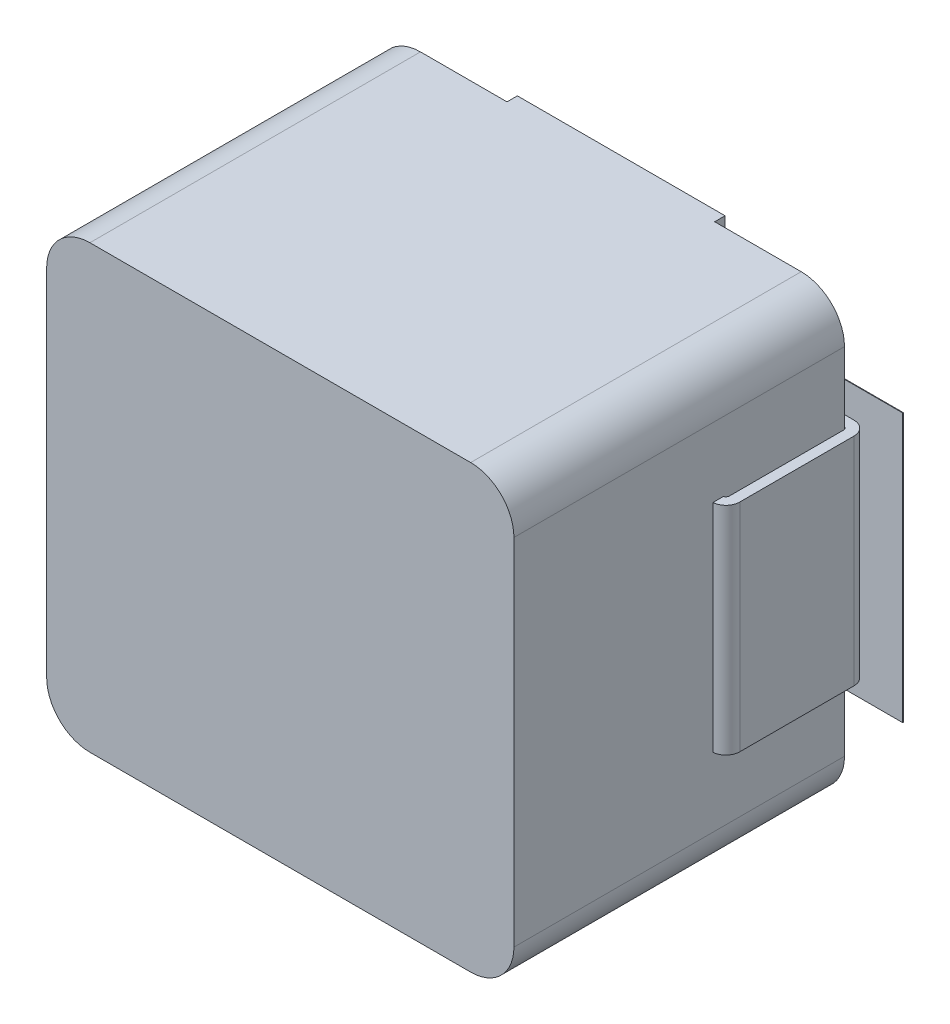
ISO-10303-21;
HEADER;
FILE_DESCRIPTION(('STEP AP214'),'2;1');
FILE_NAME('part.step','',(''),(''),'','','');
FILE_SCHEMA(('AUTOMOTIVE_DESIGN { 1 0 10303 214 1 1 1 1 }'));
ENDSEC;
DATA;
#1=APPLICATION_CONTEXT('core data for automotive mechanical design processes');
#2=APPLICATION_PROTOCOL_DEFINITION('international standard','automotive_design',2000,#1);
#3=PRODUCT_CONTEXT('',#1,'mechanical');
#4=PRODUCT('Part','Part','',(#3));
#5=PRODUCT_RELATED_PRODUCT_CATEGORY('part','',(#4));
#6=PRODUCT_DEFINITION_FORMATION('','',#4);
#7=PRODUCT_DEFINITION_CONTEXT('part definition',#1,'design');
#8=PRODUCT_DEFINITION('design','',#6,#7);
#9=PRODUCT_DEFINITION_SHAPE('','',#8);
#10=(LENGTH_UNIT() NAMED_UNIT(*) SI_UNIT(.MILLI.,.METRE.));
#11=(NAMED_UNIT(*) PLANE_ANGLE_UNIT() SI_UNIT($,.RADIAN.));
#12=(NAMED_UNIT(*) SI_UNIT($,.STERADIAN.) SOLID_ANGLE_UNIT());
#13=UNCERTAINTY_MEASURE_WITH_UNIT(LENGTH_MEASURE(1.E-05),#10,'distance_accuracy_value','');
#14=(GEOMETRIC_REPRESENTATION_CONTEXT(3) GLOBAL_UNCERTAINTY_ASSIGNED_CONTEXT((#13)) GLOBAL_UNIT_ASSIGNED_CONTEXT((#10,
#11,#12)) REPRESENTATION_CONTEXT('',''));
#15=CARTESIAN_POINT('',(0.,0.,0.));
#16=DIRECTION('',(0.,0.,1.));
#17=DIRECTION('',(1.,0.,0.));
#18=AXIS2_PLACEMENT_3D('',#15,#16,#17);
#19=CARTESIAN_POINT('',(3.4163,-1.5875,0.0762));
#20=DIRECTION('',(0.,0.,-1.));
#21=DIRECTION('',(-1.,0.,0.));
#22=AXIS2_PLACEMENT_3D('',#19,#20,#21);
#23=PLANE('',#22);
#24=DIRECTION('',(0.,1.,0.));
#25=VECTOR('',#24,1.);
#26=CARTESIAN_POINT('',(3.4163,-1.5875,0.0761999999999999));
#27=LINE('',#26,#25);
#28=CARTESIAN_POINT('',(3.4163,-1.5875,0.0762));
#29=VERTEX_POINT('',#28);
#30=CARTESIAN_POINT('',(3.4163,1.5875,0.0762));
#31=VERTEX_POINT('',#30);
#32=EDGE_CURVE('P0_E207',#29,#31,#27,.T.);
#33=ORIENTED_EDGE('',*,*,#32,.F.);
#34=DIRECTION('',(-1.,0.,0.));
#35=VECTOR('',#34,1.);
#36=CARTESIAN_POINT('',(3.4163,-1.5875,0.0762));
#37=LINE('',#36,#35);
#38=CARTESIAN_POINT('',(2.0447,-1.5875,0.0762));
#39=VERTEX_POINT('',#38);
#40=EDGE_CURVE('P0_E361',#29,#39,#37,.T.);
#41=ORIENTED_EDGE('',*,*,#40,.T.);
#42=DIRECTION('',(0.,1.,0.));
#43=VECTOR('',#42,1.);
#44=CARTESIAN_POINT('',(2.0447,-1.5875,0.0762));
#45=LINE('',#44,#43);
#46=CARTESIAN_POINT('',(2.0447,1.5875,0.0762));
#47=VERTEX_POINT('',#46);
#48=EDGE_CURVE('P0_E356',#47,#39,#45,.F.);
#49=ORIENTED_EDGE('',*,*,#48,.F.);
#50=DIRECTION('',(-1.,0.,0.));
#51=VECTOR('',#50,1.);
#52=CARTESIAN_POINT('',(3.4163,1.5875,0.0762));
#53=LINE('',#52,#51);
#54=EDGE_CURVE('P0_E380',#47,#31,#53,.F.);
#55=ORIENTED_EDGE('',*,*,#54,.T.);
#56=EDGE_LOOP('',(#33,#41,#49,#55));
#57=FACE_BOUND('',#56,.T.);
#58=ADVANCED_FACE('P0_F16',(#57),#23,.T.);
#59=CARTESIAN_POINT('',(-2.0447,-1.5875,0.0762));
#60=DIRECTION('',(0.,0.,-1.));
#61=DIRECTION('',(-1.,0.,0.));
#62=AXIS2_PLACEMENT_3D('',#59,#60,#61);
#63=PLANE('',#62);
#64=DIRECTION('',(0.,1.,0.));
#65=VECTOR('',#64,1.);
#66=CARTESIAN_POINT('',(-2.0447,-1.5875,0.0762));
#67=LINE('',#66,#65);
#68=CARTESIAN_POINT('',(-2.0447,-1.5875,0.0762));
#69=VERTEX_POINT('',#68);
#70=CARTESIAN_POINT('',(-2.0447,1.5875,0.0762));
#71=VERTEX_POINT('',#70);
#72=EDGE_CURVE('P0_E353',#69,#71,#67,.T.);
#73=ORIENTED_EDGE('',*,*,#72,.F.);
#74=DIRECTION('',(-1.,0.,0.));
#75=VECTOR('',#74,1.);
#76=CARTESIAN_POINT('',(-2.0447,-1.5875,0.0762));
#77=LINE('',#76,#75);
#78=CARTESIAN_POINT('',(-3.4163,-1.5875,0.0762));
#79=VERTEX_POINT('',#78);
#80=EDGE_CURVE('P0_E359',#69,#79,#77,.T.);
#81=ORIENTED_EDGE('',*,*,#80,.T.);
#82=DIRECTION('',(0.,1.,0.));
#83=VECTOR('',#82,1.);
#84=CARTESIAN_POINT('',(-3.4163,-1.5875,0.0761999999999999));
#85=LINE('',#84,#83);
#86=CARTESIAN_POINT('',(-3.4163,1.5875,0.0762));
#87=VERTEX_POINT('',#86);
#88=EDGE_CURVE('P0_E350',#87,#79,#85,.F.);
#89=ORIENTED_EDGE('',*,*,#88,.F.);
#90=DIRECTION('',(1.,0.,0.));
#91=VECTOR('',#90,1.);
#92=CARTESIAN_POINT('',(0.,1.5875,0.0762));
#93=LINE('',#92,#91);
#94=EDGE_CURVE('P0_E338',#71,#87,#93,.F.);
#95=ORIENTED_EDGE('',*,*,#94,.F.);
#96=EDGE_LOOP('',(#73,#81,#89,#95));
#97=FACE_BOUND('',#96,.T.);
#98=ADVANCED_FACE('P0_F708',(#97),#63,.T.);
#99=CARTESIAN_POINT('',(2.0447,-1.5875,0.0762));
#100=DIRECTION('',(-1.,0.,0.));
#101=DIRECTION('',(0.,0.,1.));
#102=AXIS2_PLACEMENT_3D('',#99,#100,#101);
#103=PLANE('',#102);
#104=DIRECTION('',(0.,0.,1.));
#105=VECTOR('',#104,1.);
#106=CARTESIAN_POINT('',(2.0447,-1.5875,0.0762));
#107=LINE('',#106,#105);
#108=CARTESIAN_POINT('',(2.0447,-1.5875,0.2286));
#109=VERTEX_POINT('',#108);
#110=EDGE_CURVE('P0_E335',#39,#109,#107,.T.);
#111=ORIENTED_EDGE('',*,*,#110,.T.);
#112=DIRECTION('',(0.,1.,0.));
#113=VECTOR('',#112,1.);
#114=CARTESIAN_POINT('',(2.0447,-3.2385,0.2286));
#115=LINE('',#114,#113);
#116=CARTESIAN_POINT('',(2.0447,1.5875,0.2286));
#117=VERTEX_POINT('',#116);
#118=EDGE_CURVE('P0_E320',#109,#117,#115,.T.);
#119=ORIENTED_EDGE('',*,*,#118,.T.);
#120=DIRECTION('',(0.,0.,1.));
#121=VECTOR('',#120,1.);
#122=CARTESIAN_POINT('',(2.0447,1.5875,0.0762));
#123=LINE('',#122,#121);
#124=EDGE_CURVE('P0_E222',#47,#117,#123,.T.);
#125=ORIENTED_EDGE('',*,*,#124,.F.);
#126=ORIENTED_EDGE('',*,*,#48,.T.);
#127=EDGE_LOOP('',(#111,#119,#125,#126));
#128=FACE_BOUND('',#127,.T.);
#129=ADVANCED_FACE('P0_F712',(#128),#103,.T.);
#130=CARTESIAN_POINT('',(-2.0447,-1.5875,0.2286));
#131=DIRECTION('',(1.,0.,0.));
#132=DIRECTION('',(0.,0.,-1.));
#133=AXIS2_PLACEMENT_3D('',#130,#131,#132);
#134=PLANE('',#133);
#135=DIRECTION('',(0.,1.,0.));
#136=VECTOR('',#135,1.);
#137=CARTESIAN_POINT('',(-2.0447,-3.2385,0.2286));
#138=LINE('',#137,#136);
#139=CARTESIAN_POINT('',(-2.0447,1.5875,0.2286));
#140=VERTEX_POINT('',#139);
#141=CARTESIAN_POINT('',(-2.0447,-1.5875,0.2286));
#142=VERTEX_POINT('',#141);
#143=EDGE_CURVE('P0_E276',#140,#142,#138,.F.);
#144=ORIENTED_EDGE('',*,*,#143,.T.);
#145=DIRECTION('',(0.,0.,1.));
#146=VECTOR('',#145,1.);
#147=CARTESIAN_POINT('',(-2.0447,-1.5875,0.0762));
#148=LINE('',#147,#146);
#149=EDGE_CURVE('P0_E279',#142,#69,#148,.F.);
#150=ORIENTED_EDGE('',*,*,#149,.T.);
#151=ORIENTED_EDGE('',*,*,#72,.T.);
#152=DIRECTION('',(0.,0.,1.));
#153=VECTOR('',#152,1.);
#154=CARTESIAN_POINT('',(-2.0447,1.5875,0.0762));
#155=LINE('',#154,#153);
#156=EDGE_CURVE('P0_E296',#140,#71,#155,.F.);
#157=ORIENTED_EDGE('',*,*,#156,.F.);
#158=EDGE_LOOP('',(#144,#150,#151,#157));
#159=FACE_BOUND('',#158,.T.);
#160=ADVANCED_FACE('P0_F710',(#159),#134,.T.);
#161=CARTESIAN_POINT('',(3.4163,-1.5875,0.2794));
#162=DIRECTION('',(0.,1.,0.));
#163=DIRECTION('',(0.,0.,1.));
#164=AXIS2_PLACEMENT_3D('',#161,#162,#163);
#165=CYLINDRICAL_SURFACE('',#164,0.2032);
#166=DIRECTION('',(0.,1.,0.));
#167=VECTOR('',#166,1.);
#168=CARTESIAN_POINT('',(3.6195,-1.5875,0.2794));
#169=LINE('',#168,#167);
#170=CARTESIAN_POINT('',(3.6195,-1.5875,0.2794));
#171=VERTEX_POINT('',#170);
#172=CARTESIAN_POINT('',(3.6195,1.5875,0.2794));
#173=VERTEX_POINT('',#172);
#174=EDGE_CURVE('P0_E239',#171,#173,#169,.T.);
#175=ORIENTED_EDGE('',*,*,#174,.F.);
#176=CARTESIAN_POINT('',(3.4163,-1.5875,0.2794));
#177=DIRECTION('',(0.,1.,0.));
#178=DIRECTION('',(0.,0.,1.));
#179=AXIS2_PLACEMENT_3D('',#176,#177,#178);
#180=CIRCLE('',#179,0.2032);
#181=EDGE_CURVE('P0_E339',#171,#29,#180,.T.);
#182=ORIENTED_EDGE('',*,*,#181,.T.);
#183=ORIENTED_EDGE('',*,*,#32,.T.);
#184=CARTESIAN_POINT('',(3.4163,1.5875,0.2794));
#185=DIRECTION('',(0.,1.,0.));
#186=DIRECTION('',(0.,0.,1.));
#187=AXIS2_PLACEMENT_3D('',#184,#185,#186);
#188=CIRCLE('',#187,0.2032);
#189=EDGE_CURVE('P0_E226',#173,#31,#188,.T.);
#190=ORIENTED_EDGE('',*,*,#189,.F.);
#191=EDGE_LOOP('',(#175,#182,#183,#190));
#192=FACE_BOUND('',#191,.T.);
#193=ADVANCED_FACE('P0_F578',(#192),#165,.T.);
#194=CARTESIAN_POINT('',(0.,1.5875,0.0762));
#195=DIRECTION('',(0.,1.,0.));
#196=DIRECTION('',(0.,0.,1.));
#197=AXIS2_PLACEMENT_3D('',#194,#195,#196);
#198=PLANE('',#197);
#199=DIRECTION('',(1.,0.,0.));
#200=VECTOR('',#199,1.);
#201=CARTESIAN_POINT('',(3.429,1.5875,0.2286));
#202=LINE('',#201,#200);
#203=CARTESIAN_POINT('',(3.429,1.5875,0.2286));
#204=VERTEX_POINT('',#203);
#205=EDGE_CURVE('P0_E220',#117,#204,#202,.T.);
#206=ORIENTED_EDGE('',*,*,#205,.T.);
#207=DIRECTION('',(0.,0.,1.));
#208=VECTOR('',#207,1.);
#209=CARTESIAN_POINT('',(3.429,1.5875,0.0762));
#210=LINE('',#209,#208);
#211=CARTESIAN_POINT('',(3.429,1.5875,0.230213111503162));
#212=VERTEX_POINT('',#211);
#213=EDGE_CURVE('P0_E210',#204,#212,#210,.T.);
#214=ORIENTED_EDGE('',*,*,#213,.T.);
#215=CARTESIAN_POINT('',(3.4163,1.5875,0.2794));
#216=DIRECTION('',(0.,1.,0.));
#217=DIRECTION('',(0.,0.,1.));
#218=AXIS2_PLACEMENT_3D('',#215,#216,#217);
#219=CIRCLE('',#218,0.0508);
#220=CARTESIAN_POINT('',(3.4671,1.5875,0.2794));
#221=VERTEX_POINT('',#220);
#222=EDGE_CURVE('P0_E19',#212,#221,#219,.F.);
#223=ORIENTED_EDGE('',*,*,#222,.T.);
#224=DIRECTION('',(0.,0.,1.));
#225=VECTOR('',#224,1.);
#226=CARTESIAN_POINT('',(3.4671,1.5875,0.2794));
#227=LINE('',#226,#225);
#228=CARTESIAN_POINT('',(3.4671,1.5875,1.9558));
#229=VERTEX_POINT('',#228);
#230=EDGE_CURVE('P0_E251',#229,#221,#227,.F.);
#231=ORIENTED_EDGE('',*,*,#230,.F.);
#232=CARTESIAN_POINT('',(3.4163,1.5875,1.9558));
#233=DIRECTION('',(0.,1.,0.));
#234=DIRECTION('',(0.,0.,1.));
#235=AXIS2_PLACEMENT_3D('',#232,#233,#234);
#236=CIRCLE('',#235,0.0508);
#237=CARTESIAN_POINT('',(3.429,1.5875,2.00498688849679));
#238=VERTEX_POINT('',#237);
#239=EDGE_CURVE('P0_E206',#229,#238,#236,.F.);
#240=ORIENTED_EDGE('',*,*,#239,.T.);
#241=DIRECTION('',(0.,0.,1.));
#242=VECTOR('',#241,1.);
#243=CARTESIAN_POINT('',(3.429,1.5875,0.0762));
#244=LINE('',#243,#242);
#245=CARTESIAN_POINT('',(3.429,1.5875,2.15860273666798));
#246=VERTEX_POINT('',#245);
#247=EDGE_CURVE('P0_E233',#238,#246,#244,.T.);
#248=ORIENTED_EDGE('',*,*,#247,.T.);
#249=CARTESIAN_POINT('',(3.4163,1.5875,1.9558));
#250=DIRECTION('',(0.,1.,0.));
#251=DIRECTION('',(0.,0.,1.));
#252=AXIS2_PLACEMENT_3D('',#249,#250,#251);
#253=CIRCLE('',#252,0.2032);
#254=CARTESIAN_POINT('',(3.6195,1.5875,1.9558));
#255=VERTEX_POINT('',#254);
#256=EDGE_CURVE('P0_E232',#246,#255,#253,.T.);
#257=ORIENTED_EDGE('',*,*,#256,.T.);
#258=DIRECTION('',(0.,0.,-1.));
#259=VECTOR('',#258,1.);
#260=CARTESIAN_POINT('',(3.6195,1.5875,1.9558));
#261=LINE('',#260,#259);
#262=EDGE_CURVE('P0_E241',#173,#255,#261,.F.);
#263=ORIENTED_EDGE('',*,*,#262,.F.);
#264=ORIENTED_EDGE('',*,*,#189,.T.);
#265=ORIENTED_EDGE('',*,*,#54,.F.);
#266=ORIENTED_EDGE('',*,*,#124,.T.);
#267=EDGE_LOOP('',(#206,#214,#223,#231,#240,#248,#257,#263,#264,#265,#266));
#268=FACE_BOUND('',#267,.T.);
#269=ADVANCED_FACE('P0_F217',(#268),#198,.T.);
#270=CARTESIAN_POINT('',(0.,-1.5875,0.0762));
#271=DIRECTION('',(0.,1.,0.));
#272=DIRECTION('',(0.,0.,1.));
#273=AXIS2_PLACEMENT_3D('',#270,#271,#272);
#274=PLANE('',#273);
#275=ORIENTED_EDGE('',*,*,#110,.F.);
#276=ORIENTED_EDGE('',*,*,#40,.F.);
#277=ORIENTED_EDGE('',*,*,#181,.F.);
#278=DIRECTION('',(0.,0.,-1.));
#279=VECTOR('',#278,1.);
#280=CARTESIAN_POINT('',(3.6195,-1.5875,1.9558));
#281=LINE('',#280,#279);
#282=CARTESIAN_POINT('',(3.6195,-1.5875,1.9558));
#283=VERTEX_POINT('',#282);
#284=EDGE_CURVE('P0_E244',#283,#171,#281,.T.);
#285=ORIENTED_EDGE('',*,*,#284,.F.);
#286=CARTESIAN_POINT('',(3.4163,-1.5875,1.9558));
#287=DIRECTION('',(0.,1.,0.));
#288=DIRECTION('',(0.,0.,1.));
#289=AXIS2_PLACEMENT_3D('',#286,#287,#288);
#290=CIRCLE('',#289,0.2032);
#291=CARTESIAN_POINT('',(3.429,-1.5875,2.15860273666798));
#292=VERTEX_POINT('',#291);
#293=EDGE_CURVE('P0_E432',#292,#283,#290,.T.);
#294=ORIENTED_EDGE('',*,*,#293,.F.);
#295=DIRECTION('',(0.,0.,1.));
#296=VECTOR('',#295,1.);
#297=CARTESIAN_POINT('',(3.429,-1.5875,0.0762));
#298=LINE('',#297,#296);
#299=CARTESIAN_POINT('',(3.429,-1.5875,2.00498688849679));
#300=VERTEX_POINT('',#299);
#301=EDGE_CURVE('P0_E434',#300,#292,#298,.T.);
#302=ORIENTED_EDGE('',*,*,#301,.F.);
#303=CARTESIAN_POINT('',(3.4163,-1.5875,1.9558));
#304=DIRECTION('',(0.,1.,0.));
#305=DIRECTION('',(0.,0.,1.));
#306=AXIS2_PLACEMENT_3D('',#303,#304,#305);
#307=CIRCLE('',#306,0.0508);
#308=CARTESIAN_POINT('',(3.4671,-1.5875,1.9558));
#309=VERTEX_POINT('',#308);
#310=EDGE_CURVE('P0_E435',#309,#300,#307,.F.);
#311=ORIENTED_EDGE('',*,*,#310,.F.);
#312=DIRECTION('',(0.,0.,1.));
#313=VECTOR('',#312,1.);
#314=CARTESIAN_POINT('',(3.4671,-1.5875,0.2794));
#315=LINE('',#314,#313);
#316=CARTESIAN_POINT('',(3.4671,-1.5875,0.2794));
#317=VERTEX_POINT('',#316);
#318=EDGE_CURVE('P0_E248',#317,#309,#315,.T.);
#319=ORIENTED_EDGE('',*,*,#318,.F.);
#320=CARTESIAN_POINT('',(3.4163,-1.5875,0.2794));
#321=DIRECTION('',(0.,1.,0.));
#322=DIRECTION('',(0.,0.,1.));
#323=AXIS2_PLACEMENT_3D('',#320,#321,#322);
#324=CIRCLE('',#323,0.0508);
#325=CARTESIAN_POINT('',(3.429,-1.5875,0.230213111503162));
#326=VERTEX_POINT('',#325);
#327=EDGE_CURVE('P0_E224',#326,#317,#324,.F.);
#328=ORIENTED_EDGE('',*,*,#327,.F.);
#329=DIRECTION('',(0.,0.,-1.));
#330=VECTOR('',#329,1.);
#331=CARTESIAN_POINT('',(3.429,-1.5875,0.0762));
#332=LINE('',#331,#330);
#333=CARTESIAN_POINT('',(3.429,-1.5875,0.2286));
#334=VERTEX_POINT('',#333);
#335=EDGE_CURVE('P0_E213',#334,#326,#332,.F.);
#336=ORIENTED_EDGE('',*,*,#335,.F.);
#337=DIRECTION('',(1.,0.,0.));
#338=VECTOR('',#337,1.);
#339=CARTESIAN_POINT('',(3.429,-1.5875,0.2286));
#340=LINE('',#339,#338);
#341=EDGE_CURVE('P0_E327',#334,#109,#340,.F.);
#342=ORIENTED_EDGE('',*,*,#341,.T.);
#343=EDGE_LOOP('',(#275,#276,#277,#285,#294,#302,#311,#319,#328,#336,#342));
#344=FACE_BOUND('',#343,.T.);
#345=ADVANCED_FACE('P0_F439',(#344),#274,.F.);
#346=CARTESIAN_POINT('',(0.,1.5875,0.0762));
#347=DIRECTION('',(0.,1.,0.));
#348=DIRECTION('',(0.,0.,1.));
#349=AXIS2_PLACEMENT_3D('',#346,#347,#348);
#350=PLANE('',#349);
#351=DIRECTION('',(1.,0.,0.));
#352=VECTOR('',#351,1.);
#353=CARTESIAN_POINT('',(-1.524,1.5875,0.2286));
#354=LINE('',#353,#352);
#355=CARTESIAN_POINT('',(-3.429,1.5875,0.2286));
#356=VERTEX_POINT('',#355);
#357=EDGE_CURVE('P0_E288',#356,#140,#354,.T.);
#358=ORIENTED_EDGE('',*,*,#357,.T.);
#359=ORIENTED_EDGE('',*,*,#156,.T.);
#360=ORIENTED_EDGE('',*,*,#94,.T.);
#361=CARTESIAN_POINT('',(-3.4163,1.5875,0.2794));
#362=DIRECTION('',(0.,1.,0.));
#363=DIRECTION('',(0.,0.,1.));
#364=AXIS2_PLACEMENT_3D('',#361,#362,#363);
#365=CIRCLE('',#364,0.2032);
#366=CARTESIAN_POINT('',(-3.6195,1.5875,0.2794));
#367=VERTEX_POINT('',#366);
#368=EDGE_CURVE('P0_E299',#367,#87,#365,.F.);
#369=ORIENTED_EDGE('',*,*,#368,.F.);
#370=DIRECTION('',(0.,0.,1.));
#371=VECTOR('',#370,1.);
#372=CARTESIAN_POINT('',(-3.6195,1.5875,0.2794));
#373=LINE('',#372,#371);
#374=CARTESIAN_POINT('',(-3.6195,1.5875,1.9558));
#375=VERTEX_POINT('',#374);
#376=EDGE_CURVE('P0_E543',#375,#367,#373,.F.);
#377=ORIENTED_EDGE('',*,*,#376,.F.);
#378=CARTESIAN_POINT('',(-3.4163,1.5875,1.9558));
#379=DIRECTION('',(0.,1.,0.));
#380=DIRECTION('',(0.,0.,1.));
#381=AXIS2_PLACEMENT_3D('',#378,#379,#380);
#382=CIRCLE('',#381,0.2032);
#383=CARTESIAN_POINT('',(-3.429,1.5875,2.15860273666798));
#384=VERTEX_POINT('',#383);
#385=EDGE_CURVE('P0_E427',#375,#384,#382,.T.);
#386=ORIENTED_EDGE('',*,*,#385,.T.);
#387=DIRECTION('',(0.,0.,1.));
#388=VECTOR('',#387,1.);
#389=CARTESIAN_POINT('',(-3.429,1.5875,0.0762));
#390=LINE('',#389,#388);
#391=CARTESIAN_POINT('',(-3.429,1.5875,2.00498688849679));
#392=VERTEX_POINT('',#391);
#393=EDGE_CURVE('P0_E426',#384,#392,#390,.F.);
#394=ORIENTED_EDGE('',*,*,#393,.T.);
#395=CARTESIAN_POINT('',(-3.4163,1.5875,1.9558));
#396=DIRECTION('',(0.,1.,0.));
#397=DIRECTION('',(0.,0.,1.));
#398=AXIS2_PLACEMENT_3D('',#395,#396,#397);
#399=CIRCLE('',#398,0.0508);
#400=CARTESIAN_POINT('',(-3.4671,1.5875,1.9558));
#401=VERTEX_POINT('',#400);
#402=EDGE_CURVE('P0_E424',#392,#401,#399,.F.);
#403=ORIENTED_EDGE('',*,*,#402,.T.);
#404=DIRECTION('',(0.,0.,-1.));
#405=VECTOR('',#404,1.);
#406=CARTESIAN_POINT('',(-3.4671,1.5875,1.9558));
#407=LINE('',#406,#405);
#408=CARTESIAN_POINT('',(-3.4671,1.5875,0.2794));
#409=VERTEX_POINT('',#408);
#410=EDGE_CURVE('P0_E561',#409,#401,#407,.F.);
#411=ORIENTED_EDGE('',*,*,#410,.F.);
#412=CARTESIAN_POINT('',(-3.4163,1.5875,0.2794));
#413=DIRECTION('',(0.,1.,0.));
#414=DIRECTION('',(0.,0.,1.));
#415=AXIS2_PLACEMENT_3D('',#412,#413,#414);
#416=CIRCLE('',#415,0.0508);
#417=CARTESIAN_POINT('',(-3.429,1.5875,0.230213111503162));
#418=VERTEX_POINT('',#417);
#419=EDGE_CURVE('P0_E421',#409,#418,#416,.F.);
#420=ORIENTED_EDGE('',*,*,#419,.T.);
#421=DIRECTION('',(0.,0.,1.));
#422=VECTOR('',#421,1.);
#423=CARTESIAN_POINT('',(-3.429,1.5875,0.0762));
#424=LINE('',#423,#422);
#425=EDGE_CURVE('P0_E300',#418,#356,#424,.F.);
#426=ORIENTED_EDGE('',*,*,#425,.T.);
#427=EDGE_LOOP('',(#358,#359,#360,#369,#377,#386,#394,#403,#411,#420,#426));
#428=FACE_BOUND('',#427,.T.);
#429=ADVANCED_FACE('P0_F680',(#428),#350,.T.);
#430=CARTESIAN_POINT('',(-3.4163,-1.5875,0.2794));
#431=DIRECTION('',(0.,1.,0.));
#432=DIRECTION('',(0.,0.,1.));
#433=AXIS2_PLACEMENT_3D('',#430,#431,#432);
#434=CYLINDRICAL_SURFACE('',#433,0.2032);
#435=ORIENTED_EDGE('',*,*,#88,.T.);
#436=CARTESIAN_POINT('',(-3.4163,-1.5875,0.2794));
#437=DIRECTION('',(0.,1.,0.));
#438=DIRECTION('',(0.,0.,1.));
#439=AXIS2_PLACEMENT_3D('',#436,#437,#438);
#440=CIRCLE('',#439,0.2032);
#441=CARTESIAN_POINT('',(-3.6195,-1.5875,0.2794));
#442=VERTEX_POINT('',#441);
#443=EDGE_CURVE('P0_E282',#79,#442,#440,.T.);
#444=ORIENTED_EDGE('',*,*,#443,.T.);
#445=DIRECTION('',(0.,1.,0.));
#446=VECTOR('',#445,1.);
#447=CARTESIAN_POINT('',(-3.6195,-1.5875,0.2794));
#448=LINE('',#447,#446);
#449=EDGE_CURVE('P0_E540',#367,#442,#448,.F.);
#450=ORIENTED_EDGE('',*,*,#449,.F.);
#451=ORIENTED_EDGE('',*,*,#368,.T.);
#452=EDGE_LOOP('',(#435,#444,#450,#451));
#453=FACE_BOUND('',#452,.T.);
#454=ADVANCED_FACE('P0_F705',(#453),#434,.T.);
#455=CARTESIAN_POINT('',(0.,-1.5875,0.0762));
#456=DIRECTION('',(0.,1.,0.));
#457=DIRECTION('',(0.,0.,1.));
#458=AXIS2_PLACEMENT_3D('',#455,#456,#457);
#459=PLANE('',#458);
#460=DIRECTION('',(0.,0.,-1.));
#461=VECTOR('',#460,1.);
#462=CARTESIAN_POINT('',(-3.4671,-1.5875,1.9558));
#463=LINE('',#462,#461);
#464=CARTESIAN_POINT('',(-3.4671,-1.5875,1.9558));
#465=VERTEX_POINT('',#464);
#466=CARTESIAN_POINT('',(-3.4671,-1.5875,0.2794));
#467=VERTEX_POINT('',#466);
#468=EDGE_CURVE('P0_E551',#465,#467,#463,.T.);
#469=ORIENTED_EDGE('',*,*,#468,.F.);
#470=CARTESIAN_POINT('',(-3.4163,-1.5875,1.9558));
#471=DIRECTION('',(0.,1.,0.));
#472=DIRECTION('',(0.,0.,1.));
#473=AXIS2_PLACEMENT_3D('',#470,#471,#472);
#474=CIRCLE('',#473,0.0508);
#475=CARTESIAN_POINT('',(-3.429,-1.5875,2.00498688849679));
#476=VERTEX_POINT('',#475);
#477=EDGE_CURVE('P0_E410',#476,#465,#474,.F.);
#478=ORIENTED_EDGE('',*,*,#477,.F.);
#479=DIRECTION('',(0.,0.,1.));
#480=VECTOR('',#479,1.);
#481=CARTESIAN_POINT('',(-3.429,-1.5875,0.0762));
#482=LINE('',#481,#480);
#483=CARTESIAN_POINT('',(-3.429,-1.5875,2.15860273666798));
#484=VERTEX_POINT('',#483);
#485=EDGE_CURVE('P0_E412',#484,#476,#482,.F.);
#486=ORIENTED_EDGE('',*,*,#485,.F.);
#487=CARTESIAN_POINT('',(-3.4163,-1.5875,1.9558));
#488=DIRECTION('',(0.,1.,0.));
#489=DIRECTION('',(0.,0.,1.));
#490=AXIS2_PLACEMENT_3D('',#487,#488,#489);
#491=CIRCLE('',#490,0.2032);
#492=CARTESIAN_POINT('',(-3.6195,-1.5875,1.9558));
#493=VERTEX_POINT('',#492);
#494=EDGE_CURVE('P0_E413',#493,#484,#491,.T.);
#495=ORIENTED_EDGE('',*,*,#494,.F.);
#496=DIRECTION('',(0.,0.,1.));
#497=VECTOR('',#496,1.);
#498=CARTESIAN_POINT('',(-3.6195,-1.5875,0.2794));
#499=LINE('',#498,#497);
#500=EDGE_CURVE('P0_E307',#442,#493,#499,.T.);
#501=ORIENTED_EDGE('',*,*,#500,.F.);
#502=ORIENTED_EDGE('',*,*,#443,.F.);
#503=ORIENTED_EDGE('',*,*,#80,.F.);
#504=ORIENTED_EDGE('',*,*,#149,.F.);
#505=DIRECTION('',(1.,0.,0.));
#506=VECTOR('',#505,1.);
#507=CARTESIAN_POINT('',(-1.524,-1.5875,0.2286));
#508=LINE('',#507,#506);
#509=CARTESIAN_POINT('',(-3.429,-1.5875,0.2286));
#510=VERTEX_POINT('',#509);
#511=EDGE_CURVE('P0_E272',#142,#510,#508,.F.);
#512=ORIENTED_EDGE('',*,*,#511,.T.);
#513=DIRECTION('',(0.,0.,1.));
#514=VECTOR('',#513,1.);
#515=CARTESIAN_POINT('',(-3.429,-1.5875,0.0762));
#516=LINE('',#515,#514);
#517=CARTESIAN_POINT('',(-3.429,-1.5875,0.230213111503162));
#518=VERTEX_POINT('',#517);
#519=EDGE_CURVE('P0_E283',#518,#510,#516,.F.);
#520=ORIENTED_EDGE('',*,*,#519,.F.);
#521=CARTESIAN_POINT('',(-3.4163,-1.5875,0.2794));
#522=DIRECTION('',(0.,1.,0.));
#523=DIRECTION('',(0.,0.,1.));
#524=AXIS2_PLACEMENT_3D('',#521,#522,#523);
#525=CIRCLE('',#524,0.0508);
#526=EDGE_CURVE('P0_E408',#467,#518,#525,.F.);
#527=ORIENTED_EDGE('',*,*,#526,.F.);
#528=EDGE_LOOP('',(#469,#478,#486,#495,#501,#502,#503,#504,#512,#520,#527));
#529=FACE_BOUND('',#528,.T.);
#530=ADVANCED_FACE('P0_F687',(#529),#459,.F.);
#531=CARTESIAN_POINT('',(3.429,-3.2385,0.2286));
#532=DIRECTION('',(0.,0.,1.));
#533=DIRECTION('',(1.,0.,0.));
#534=AXIS2_PLACEMENT_3D('',#531,#532,#533);
#535=PLANE('',#534);
#536=DIRECTION('',(1.,0.,0.));
#537=VECTOR('',#536,1.);
#538=CARTESIAN_POINT('',(3.429,-3.2385,0.2286));
#539=LINE('',#538,#537);
#540=CARTESIAN_POINT('',(1.524,-3.2385,0.2286));
#541=VERTEX_POINT('',#540);
#542=CARTESIAN_POINT('',(2.794,-3.2385,0.2286));
#543=VERTEX_POINT('',#542);
#544=EDGE_CURVE('P0_E404',#541,#543,#539,.T.);
#545=ORIENTED_EDGE('',*,*,#544,.F.);
#546=DIRECTION('',(0.,1.,0.));
#547=VECTOR('',#546,1.);
#548=CARTESIAN_POINT('',(1.524,-3.2385,0.2286));
#549=LINE('',#548,#547);
#550=CARTESIAN_POINT('',(1.524,3.2385,0.2286));
#551=VERTEX_POINT('',#550);
#552=EDGE_CURVE('P0_E306',#541,#551,#549,.T.);
#553=ORIENTED_EDGE('',*,*,#552,.T.);
#554=DIRECTION('',(1.,0.,0.));
#555=VECTOR('',#554,1.);
#556=CARTESIAN_POINT('',(3.429,3.2385,0.2286));
#557=LINE('',#556,#555);
#558=CARTESIAN_POINT('',(2.794,3.2385,0.2286));
#559=VERTEX_POINT('',#558);
#560=EDGE_CURVE('P0_E407',#559,#551,#557,.F.);
#561=ORIENTED_EDGE('',*,*,#560,.F.);
#562=CARTESIAN_POINT('',(2.794,2.6035,0.2286));
#563=DIRECTION('',(0.,0.,-1.));
#564=DIRECTION('',(-1.,0.,0.));
#565=AXIS2_PLACEMENT_3D('',#562,#563,#564);
#566=CIRCLE('',#565,0.635);
#567=CARTESIAN_POINT('',(3.429,2.6035,0.2286));
#568=VERTEX_POINT('',#567);
#569=EDGE_CURVE('P0_E405',#568,#559,#566,.F.);
#570=ORIENTED_EDGE('',*,*,#569,.F.);
#571=DIRECTION('',(0.,1.,0.));
#572=VECTOR('',#571,1.);
#573=CARTESIAN_POINT('',(3.429,-3.2385,0.2286));
#574=LINE('',#573,#572);
#575=EDGE_CURVE('P0_E319',#204,#568,#574,.T.);
#576=ORIENTED_EDGE('',*,*,#575,.F.);
#577=ORIENTED_EDGE('',*,*,#205,.F.);
#578=ORIENTED_EDGE('',*,*,#118,.F.);
#579=ORIENTED_EDGE('',*,*,#341,.F.);
#580=DIRECTION('',(0.,1.,0.));
#581=VECTOR('',#580,1.);
#582=CARTESIAN_POINT('',(3.429,-3.2385,0.2286));
#583=LINE('',#582,#581);
#584=CARTESIAN_POINT('',(3.429,-2.6035,0.2286));
#585=VERTEX_POINT('',#584);
#586=EDGE_CURVE('P0_E332',#585,#334,#583,.T.);
#587=ORIENTED_EDGE('',*,*,#586,.F.);
#588=CARTESIAN_POINT('',(2.794,-2.6035,0.2286));
#589=DIRECTION('',(0.,0.,-1.));
#590=DIRECTION('',(-1.,0.,0.));
#591=AXIS2_PLACEMENT_3D('',#588,#589,#590);
#592=CIRCLE('',#591,0.635);
#593=EDGE_CURVE('P0_E402',#543,#585,#592,.F.);
#594=ORIENTED_EDGE('',*,*,#593,.F.);
#595=EDGE_LOOP('',(#545,#553,#561,#570,#576,#577,#578,#579,#587,#594));
#596=FACE_BOUND('',#595,.T.);
#597=ADVANCED_FACE('P0_F651',(#596),#535,.F.);
#598=CARTESIAN_POINT('',(-1.524,-3.2385,0.2286));
#599=DIRECTION('',(0.,0.,1.));
#600=DIRECTION('',(1.,0.,0.));
#601=AXIS2_PLACEMENT_3D('',#598,#599,#600);
#602=PLANE('',#601);
#603=DIRECTION('',(1.,0.,0.));
#604=VECTOR('',#603,1.);
#605=CARTESIAN_POINT('',(-1.524,3.2385,0.2286));
#606=LINE('',#605,#604);
#607=CARTESIAN_POINT('',(-1.524,3.2385,0.2286));
#608=VERTEX_POINT('',#607);
#609=CARTESIAN_POINT('',(-2.794,3.2385,0.2286));
#610=VERTEX_POINT('',#609);
#611=EDGE_CURVE('P0_E398',#608,#610,#606,.F.);
#612=ORIENTED_EDGE('',*,*,#611,.F.);
#613=DIRECTION('',(0.,1.,0.));
#614=VECTOR('',#613,1.);
#615=CARTESIAN_POINT('',(-1.524,-3.2385,0.2286));
#616=LINE('',#615,#614);
#617=CARTESIAN_POINT('',(-1.524,-3.2385,0.2286));
#618=VERTEX_POINT('',#617);
#619=EDGE_CURVE('P0_E247',#608,#618,#616,.F.);
#620=ORIENTED_EDGE('',*,*,#619,.T.);
#621=DIRECTION('',(1.,0.,0.));
#622=VECTOR('',#621,1.);
#623=CARTESIAN_POINT('',(-1.524,-3.2385,0.2286));
#624=LINE('',#623,#622);
#625=CARTESIAN_POINT('',(-2.794,-3.2385,0.2286));
#626=VERTEX_POINT('',#625);
#627=EDGE_CURVE('P0_E401',#626,#618,#624,.T.);
#628=ORIENTED_EDGE('',*,*,#627,.F.);
#629=CARTESIAN_POINT('',(-2.794,-2.6035,0.2286));
#630=DIRECTION('',(0.,0.,-1.));
#631=DIRECTION('',(-1.,0.,0.));
#632=AXIS2_PLACEMENT_3D('',#629,#630,#631);
#633=CIRCLE('',#632,0.635);
#634=CARTESIAN_POINT('',(-3.429,-2.6035,0.2286));
#635=VERTEX_POINT('',#634);
#636=EDGE_CURVE('P0_E399',#635,#626,#633,.F.);
#637=ORIENTED_EDGE('',*,*,#636,.F.);
#638=DIRECTION('',(0.,1.,0.));
#639=VECTOR('',#638,1.);
#640=CARTESIAN_POINT('',(-3.429,-3.2385,0.2286));
#641=LINE('',#640,#639);
#642=EDGE_CURVE('P0_E275',#510,#635,#641,.F.);
#643=ORIENTED_EDGE('',*,*,#642,.F.);
#644=ORIENTED_EDGE('',*,*,#511,.F.);
#645=ORIENTED_EDGE('',*,*,#143,.F.);
#646=ORIENTED_EDGE('',*,*,#357,.F.);
#647=DIRECTION('',(0.,1.,0.));
#648=VECTOR('',#647,1.);
#649=CARTESIAN_POINT('',(-3.429,-3.2385,0.2286));
#650=LINE('',#649,#648);
#651=CARTESIAN_POINT('',(-3.429,2.6035,0.2286));
#652=VERTEX_POINT('',#651);
#653=EDGE_CURVE('P0_E293',#652,#356,#650,.F.);
#654=ORIENTED_EDGE('',*,*,#653,.F.);
#655=CARTESIAN_POINT('',(-2.794,2.6035,0.2286));
#656=DIRECTION('',(0.,0.,-1.));
#657=DIRECTION('',(-1.,0.,0.));
#658=AXIS2_PLACEMENT_3D('',#655,#656,#657);
#659=CIRCLE('',#658,0.635);
#660=EDGE_CURVE('P0_E256',#610,#652,#659,.F.);
#661=ORIENTED_EDGE('',*,*,#660,.F.);
#662=EDGE_LOOP('',(#612,#620,#628,#637,#643,#644,#645,#646,#654,#661));
#663=FACE_BOUND('',#662,.T.);
#664=ADVANCED_FACE('P0_F673',(#663),#602,.F.);
#665=CARTESIAN_POINT('',(3.4671,-1.5875,0.2794));
#666=DIRECTION('',(-1.,0.,0.));
#667=DIRECTION('',(0.,0.,1.));
#668=AXIS2_PLACEMENT_3D('',#665,#666,#667);
#669=PLANE('',#668);
#670=DIRECTION('',(0.,1.,0.));
#671=VECTOR('',#670,1.);
#672=CARTESIAN_POINT('',(3.4671,-1.5875,0.2794));
#673=LINE('',#672,#671);
#674=EDGE_CURVE('P0_E201',#221,#317,#673,.F.);
#675=ORIENTED_EDGE('',*,*,#674,.T.);
#676=ORIENTED_EDGE('',*,*,#318,.T.);
#677=DIRECTION('',(0.,1.,0.));
#678=VECTOR('',#677,1.);
#679=CARTESIAN_POINT('',(3.4671,-1.5875,1.9558));
#680=LINE('',#679,#678);
#681=EDGE_CURVE('P0_E246',#309,#229,#680,.T.);
#682=ORIENTED_EDGE('',*,*,#681,.T.);
#683=ORIENTED_EDGE('',*,*,#230,.T.);
#684=EDGE_LOOP('',(#675,#676,#682,#683));
#685=FACE_BOUND('',#684,.T.);
#686=ADVANCED_FACE('P0_F443',(#685),#669,.T.);
#687=CARTESIAN_POINT('',(3.6195,-1.5875,1.9558));
#688=DIRECTION('',(1.,0.,0.));
#689=DIRECTION('',(0.,0.,-1.));
#690=AXIS2_PLACEMENT_3D('',#687,#688,#689);
#691=PLANE('',#690);
#692=DIRECTION('',(0.,1.,0.));
#693=VECTOR('',#692,1.);
#694=CARTESIAN_POINT('',(3.6195,-1.5875,1.9558));
#695=LINE('',#694,#693);
#696=EDGE_CURVE('P0_E254',#283,#255,#695,.T.);
#697=ORIENTED_EDGE('',*,*,#696,.F.);
#698=ORIENTED_EDGE('',*,*,#284,.T.);
#699=ORIENTED_EDGE('',*,*,#174,.T.);
#700=ORIENTED_EDGE('',*,*,#262,.T.);
#701=EDGE_LOOP('',(#697,#698,#699,#700));
#702=FACE_BOUND('',#701,.T.);
#703=ADVANCED_FACE('P0_F573',(#702),#691,.T.);
#704=CARTESIAN_POINT('',(-3.4671,-1.5875,1.9558));
#705=DIRECTION('',(1.,0.,0.));
#706=DIRECTION('',(0.,0.,-1.));
#707=AXIS2_PLACEMENT_3D('',#704,#705,#706);
#708=PLANE('',#707);
#709=DIRECTION('',(0.,1.,0.));
#710=VECTOR('',#709,1.);
#711=CARTESIAN_POINT('',(-3.4671,-1.5875,1.9558));
#712=LINE('',#711,#710);
#713=EDGE_CURVE('P0_E548',#401,#465,#712,.F.);
#714=ORIENTED_EDGE('',*,*,#713,.T.);
#715=ORIENTED_EDGE('',*,*,#468,.T.);
#716=DIRECTION('',(0.,1.,0.));
#717=VECTOR('',#716,1.);
#718=CARTESIAN_POINT('',(-3.4671,-1.5875,0.2794));
#719=LINE('',#718,#717);
#720=EDGE_CURVE('P0_E394',#467,#409,#719,.T.);
#721=ORIENTED_EDGE('',*,*,#720,.T.);
#722=ORIENTED_EDGE('',*,*,#410,.T.);
#723=EDGE_LOOP('',(#714,#715,#721,#722));
#724=FACE_BOUND('',#723,.T.);
#725=ADVANCED_FACE('P0_F690',(#724),#708,.T.);
#726=CARTESIAN_POINT('',(-3.6195,-1.5875,0.2794));
#727=DIRECTION('',(-1.,0.,0.));
#728=DIRECTION('',(0.,0.,1.));
#729=AXIS2_PLACEMENT_3D('',#726,#727,#728);
#730=PLANE('',#729);
#731=ORIENTED_EDGE('',*,*,#449,.T.);
#732=ORIENTED_EDGE('',*,*,#500,.T.);
#733=DIRECTION('',(0.,1.,0.));
#734=VECTOR('',#733,1.);
#735=CARTESIAN_POINT('',(-3.6195,-1.5875,1.9558));
#736=LINE('',#735,#734);
#737=EDGE_CURVE('P0_E391',#375,#493,#736,.F.);
#738=ORIENTED_EDGE('',*,*,#737,.F.);
#739=ORIENTED_EDGE('',*,*,#376,.T.);
#740=EDGE_LOOP('',(#731,#732,#738,#739));
#741=FACE_BOUND('',#740,.T.);
#742=ADVANCED_FACE('P0_F700',(#741),#730,.T.);
#743=CARTESIAN_POINT('',(1.524,-3.2385,0.2286));
#744=DIRECTION('',(-1.,0.,0.));
#745=DIRECTION('',(0.,0.,1.));
#746=AXIS2_PLACEMENT_3D('',#743,#744,#745);
#747=PLANE('',#746);
#748=DIRECTION('',(0.,0.,1.));
#749=VECTOR('',#748,1.);
#750=CARTESIAN_POINT('',(1.524,3.2385,0.2286));
#751=LINE('',#750,#749);
#752=CARTESIAN_POINT('',(1.524,3.2385,0.0762));
#753=VERTEX_POINT('',#752);
#754=EDGE_CURVE('P0_E269',#551,#753,#751,.F.);
#755=ORIENTED_EDGE('',*,*,#754,.F.);
#756=ORIENTED_EDGE('',*,*,#552,.F.);
#757=DIRECTION('',(0.,0.,1.));
#758=VECTOR('',#757,1.);
#759=CARTESIAN_POINT('',(1.524,-3.2385,0.2286));
#760=LINE('',#759,#758);
#761=CARTESIAN_POINT('',(1.524,-3.2385,0.0762));
#762=VERTEX_POINT('',#761);
#763=EDGE_CURVE('P0_E303',#762,#541,#760,.T.);
#764=ORIENTED_EDGE('',*,*,#763,.F.);
#765=DIRECTION('',(0.,1.,0.));
#766=VECTOR('',#765,1.);
#767=CARTESIAN_POINT('',(1.524,0.,0.0762));
#768=LINE('',#767,#766);
#769=EDGE_CURVE('P0_E389',#762,#753,#768,.T.);
#770=ORIENTED_EDGE('',*,*,#769,.T.);
#771=EDGE_LOOP('',(#755,#756,#764,#770));
#772=FACE_BOUND('',#771,.T.);
#773=ADVANCED_FACE('P0_F734',(#772),#747,.F.);
#774=CARTESIAN_POINT('',(-1.524,-3.2385,0.0762));
#775=DIRECTION('',(1.,0.,0.));
#776=DIRECTION('',(0.,0.,-1.));
#777=AXIS2_PLACEMENT_3D('',#774,#775,#776);
#778=PLANE('',#777);
#779=DIRECTION('',(0.,0.,-1.));
#780=VECTOR('',#779,1.);
#781=CARTESIAN_POINT('',(-1.524,3.2385,0.0762));
#782=LINE('',#781,#780);
#783=CARTESIAN_POINT('',(-1.524,3.2385,0.0762));
#784=VERTEX_POINT('',#783);
#785=EDGE_CURVE('P0_E257',#784,#608,#782,.F.);
#786=ORIENTED_EDGE('',*,*,#785,.F.);
#787=DIRECTION('',(0.,1.,0.));
#788=VECTOR('',#787,1.);
#789=CARTESIAN_POINT('',(-1.524,0.,0.0762));
#790=LINE('',#789,#788);
#791=CARTESIAN_POINT('',(-1.524,-3.2385,0.0762));
#792=VERTEX_POINT('',#791);
#793=EDGE_CURVE('P0_E215',#784,#792,#790,.F.);
#794=ORIENTED_EDGE('',*,*,#793,.T.);
#795=DIRECTION('',(0.,0.,-1.));
#796=VECTOR('',#795,1.);
#797=CARTESIAN_POINT('',(-1.524,-3.2385,0.0762));
#798=LINE('',#797,#796);
#799=EDGE_CURVE('P0_E260',#618,#792,#798,.T.);
#800=ORIENTED_EDGE('',*,*,#799,.F.);
#801=ORIENTED_EDGE('',*,*,#619,.F.);
#802=EDGE_LOOP('',(#786,#794,#800,#801));
#803=FACE_BOUND('',#802,.T.);
#804=ADVANCED_FACE('P0_F596',(#803),#778,.F.);
#805=CARTESIAN_POINT('',(3.4163,-1.5875,0.2794));
#806=DIRECTION('',(0.,1.,0.));
#807=DIRECTION('',(0.,0.,1.));
#808=AXIS2_PLACEMENT_3D('',#805,#806,#807);
#809=CYLINDRICAL_SURFACE('',#808,0.0508);
#810=ORIENTED_EDGE('',*,*,#674,.F.);
#811=ORIENTED_EDGE('',*,*,#222,.F.);
#812=DIRECTION('',(0.,1.,0.));
#813=VECTOR('',#812,1.);
#814=CARTESIAN_POINT('',(3.429,-3.2385,0.230213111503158));
#815=LINE('',#814,#813);
#816=EDGE_CURVE('P0_E198',#326,#212,#815,.T.);
#817=ORIENTED_EDGE('',*,*,#816,.F.);
#818=ORIENTED_EDGE('',*,*,#327,.T.);
#819=EDGE_LOOP('',(#810,#811,#817,#818));
#820=FACE_BOUND('',#819,.T.);
#821=ADVANCED_FACE('P0_F197',(#820),#809,.F.);
#822=CARTESIAN_POINT('',(3.4163,-1.5875,1.9558));
#823=DIRECTION('',(0.,1.,0.));
#824=DIRECTION('',(0.,0.,1.));
#825=AXIS2_PLACEMENT_3D('',#822,#823,#824);
#826=CYLINDRICAL_SURFACE('',#825,0.0508);
#827=ORIENTED_EDGE('',*,*,#681,.F.);
#828=ORIENTED_EDGE('',*,*,#310,.T.);
#829=DIRECTION('',(0.,1.,0.));
#830=VECTOR('',#829,1.);
#831=CARTESIAN_POINT('',(3.429,-3.2385,2.00498688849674));
#832=LINE('',#831,#830);
#833=EDGE_CURVE('P0_E374',#238,#300,#832,.F.);
#834=ORIENTED_EDGE('',*,*,#833,.F.);
#835=ORIENTED_EDGE('',*,*,#239,.F.);
#836=EDGE_LOOP('',(#827,#828,#834,#835));
#837=FACE_BOUND('',#836,.T.);
#838=ADVANCED_FACE('P0_F586',(#837),#826,.F.);
#839=CARTESIAN_POINT('',(3.4163,-1.5875,1.9558));
#840=DIRECTION('',(0.,1.,0.));
#841=DIRECTION('',(0.,0.,1.));
#842=AXIS2_PLACEMENT_3D('',#839,#840,#841);
#843=CYLINDRICAL_SURFACE('',#842,0.2032);
#844=ORIENTED_EDGE('',*,*,#256,.F.);
#845=DIRECTION('',(0.,1.,0.));
#846=VECTOR('',#845,1.);
#847=CARTESIAN_POINT('',(3.429,-3.2385,2.15860273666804));
#848=LINE('',#847,#846);
#849=EDGE_CURVE('P0_E370',#292,#246,#848,.T.);
#850=ORIENTED_EDGE('',*,*,#849,.F.);
#851=ORIENTED_EDGE('',*,*,#293,.T.);
#852=ORIENTED_EDGE('',*,*,#696,.T.);
#853=EDGE_LOOP('',(#844,#850,#851,#852));
#854=FACE_BOUND('',#853,.T.);
#855=ADVANCED_FACE('P0_F581',(#854),#843,.T.);
#856=CARTESIAN_POINT('',(2.794,2.6035,5.0982772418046));
#857=DIRECTION('',(0.,0.,-1.));
#858=DIRECTION('',(-1.,0.,0.));
#859=AXIS2_PLACEMENT_3D('',#856,#857,#858);
#860=CYLINDRICAL_SURFACE('',#859,0.635);
#861=DIRECTION('',(0.,0.,-1.));
#862=VECTOR('',#861,1.);
#863=CARTESIAN_POINT('',(3.429,2.6035,0.0762));
#864=LINE('',#863,#862);
#865=CARTESIAN_POINT('',(3.429,2.6035,5.08));
#866=VERTEX_POINT('',#865);
#867=EDGE_CURVE('P0_E214',#568,#866,#864,.F.);
#868=ORIENTED_EDGE('',*,*,#867,.F.);
#869=ORIENTED_EDGE('',*,*,#569,.T.);
#870=DIRECTION('',(0.,0.,1.));
#871=VECTOR('',#870,1.);
#872=CARTESIAN_POINT('',(2.794,3.2385,0.0762));
#873=LINE('',#872,#871);
#874=CARTESIAN_POINT('',(2.794,3.2385,5.08));
#875=VERTEX_POINT('',#874);
#876=EDGE_CURVE('P0_E490',#875,#559,#873,.F.);
#877=ORIENTED_EDGE('',*,*,#876,.F.);
#878=CARTESIAN_POINT('',(2.794,2.6035,5.08));
#879=DIRECTION('',(0.,0.,-1.));
#880=DIRECTION('',(-1.,0.,0.));
#881=AXIS2_PLACEMENT_3D('',#878,#879,#880);
#882=CIRCLE('',#881,0.635);
#883=EDGE_CURVE('P0_E395',#875,#866,#882,.T.);
#884=ORIENTED_EDGE('',*,*,#883,.T.);
#885=EDGE_LOOP('',(#868,#869,#877,#884));
#886=FACE_BOUND('',#885,.T.);
#887=ADVANCED_FACE('P0_F594',(#886),#860,.T.);
#888=CARTESIAN_POINT('',(-2.794,2.6035,5.0982772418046));
#889=DIRECTION('',(0.,0.,-1.));
#890=DIRECTION('',(-1.,0.,0.));
#891=AXIS2_PLACEMENT_3D('',#888,#889,#890);
#892=CYLINDRICAL_SURFACE('',#891,0.635);
#893=DIRECTION('',(0.,0.,1.));
#894=VECTOR('',#893,1.);
#895=CARTESIAN_POINT('',(-2.794,3.2385,0.0762));
#896=LINE('',#895,#894);
#897=CARTESIAN_POINT('',(-2.794,3.2385,5.08));
#898=VERTEX_POINT('',#897);
#899=EDGE_CURVE('P0_E510',#610,#898,#896,.T.);
#900=ORIENTED_EDGE('',*,*,#899,.F.);
#901=ORIENTED_EDGE('',*,*,#660,.T.);
#902=DIRECTION('',(0.,0.,1.));
#903=VECTOR('',#902,1.);
#904=CARTESIAN_POINT('',(-3.429,2.6035,0.0762));
#905=LINE('',#904,#903);
#906=CARTESIAN_POINT('',(-3.429,2.6035,5.08));
#907=VERTEX_POINT('',#906);
#908=EDGE_CURVE('P0_E489',#907,#652,#905,.F.);
#909=ORIENTED_EDGE('',*,*,#908,.F.);
#910=CARTESIAN_POINT('',(-2.794,2.6035,5.08));
#911=DIRECTION('',(0.,0.,-1.));
#912=DIRECTION('',(-1.,0.,0.));
#913=AXIS2_PLACEMENT_3D('',#910,#911,#912);
#914=CIRCLE('',#913,0.635);
#915=EDGE_CURVE('P0_E392',#907,#898,#914,.T.);
#916=ORIENTED_EDGE('',*,*,#915,.T.);
#917=EDGE_LOOP('',(#900,#901,#909,#916));
#918=FACE_BOUND('',#917,.T.);
#919=ADVANCED_FACE('P0_F635',(#918),#892,.T.);
#920=CARTESIAN_POINT('',(-3.4163,-1.5875,0.2794));
#921=DIRECTION('',(0.,1.,0.));
#922=DIRECTION('',(0.,0.,1.));
#923=AXIS2_PLACEMENT_3D('',#920,#921,#922);
#924=CYLINDRICAL_SURFACE('',#923,0.0508);
#925=ORIENTED_EDGE('',*,*,#720,.F.);
#926=ORIENTED_EDGE('',*,*,#526,.T.);
#927=DIRECTION('',(0.,1.,0.));
#928=VECTOR('',#927,1.);
#929=CARTESIAN_POINT('',(-3.429,3.2385,0.230213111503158));
#930=LINE('',#929,#928);
#931=EDGE_CURVE('P0_E346',#418,#518,#930,.F.);
#932=ORIENTED_EDGE('',*,*,#931,.F.);
#933=ORIENTED_EDGE('',*,*,#419,.F.);
#934=EDGE_LOOP('',(#925,#926,#932,#933));
#935=FACE_BOUND('',#934,.T.);
#936=ADVANCED_FACE('P0_F631',(#935),#924,.F.);
#937=CARTESIAN_POINT('',(-3.4163,-1.5875,1.9558));
#938=DIRECTION('',(0.,1.,0.));
#939=DIRECTION('',(0.,0.,1.));
#940=AXIS2_PLACEMENT_3D('',#937,#938,#939);
#941=CYLINDRICAL_SURFACE('',#940,0.0508);
#942=ORIENTED_EDGE('',*,*,#713,.F.);
#943=ORIENTED_EDGE('',*,*,#402,.F.);
#944=DIRECTION('',(0.,1.,0.));
#945=VECTOR('',#944,1.);
#946=CARTESIAN_POINT('',(-3.429,3.2385,2.00498688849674));
#947=LINE('',#946,#945);
#948=EDGE_CURVE('P0_E342',#476,#392,#947,.T.);
#949=ORIENTED_EDGE('',*,*,#948,.F.);
#950=ORIENTED_EDGE('',*,*,#477,.T.);
#951=EDGE_LOOP('',(#942,#943,#949,#950));
#952=FACE_BOUND('',#951,.T.);
#953=ADVANCED_FACE('P0_F627',(#952),#941,.F.);
#954=CARTESIAN_POINT('',(-3.4163,-1.5875,1.9558));
#955=DIRECTION('',(0.,1.,0.));
#956=DIRECTION('',(0.,0.,1.));
#957=AXIS2_PLACEMENT_3D('',#954,#955,#956);
#958=CYLINDRICAL_SURFACE('',#957,0.2032);
#959=ORIENTED_EDGE('',*,*,#494,.T.);
#960=DIRECTION('',(0.,1.,0.));
#961=VECTOR('',#960,1.);
#962=CARTESIAN_POINT('',(-3.429,3.2385,2.15860273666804));
#963=LINE('',#962,#961);
#964=EDGE_CURVE('P0_E345',#384,#484,#963,.F.);
#965=ORIENTED_EDGE('',*,*,#964,.F.);
#966=ORIENTED_EDGE('',*,*,#385,.F.);
#967=ORIENTED_EDGE('',*,*,#737,.T.);
#968=EDGE_LOOP('',(#959,#965,#966,#967));
#969=FACE_BOUND('',#968,.T.);
#970=ADVANCED_FACE('P0_F624',(#969),#958,.T.);
#971=CARTESIAN_POINT('',(2.794,-2.6035,5.0982772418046));
#972=DIRECTION('',(0.,0.,-1.));
#973=DIRECTION('',(-1.,0.,0.));
#974=AXIS2_PLACEMENT_3D('',#971,#972,#973);
#975=CYLINDRICAL_SURFACE('',#974,0.635);
#976=DIRECTION('',(0.,0.,-1.));
#977=VECTOR('',#976,1.);
#978=CARTESIAN_POINT('',(2.794,-3.2385,0.0762));
#979=LINE('',#978,#977);
#980=CARTESIAN_POINT('',(2.794,-3.2385,5.08));
#981=VERTEX_POINT('',#980);
#982=EDGE_CURVE('P0_E349',#543,#981,#979,.F.);
#983=ORIENTED_EDGE('',*,*,#982,.F.);
#984=ORIENTED_EDGE('',*,*,#593,.T.);
#985=DIRECTION('',(0.,0.,-1.));
#986=VECTOR('',#985,1.);
#987=CARTESIAN_POINT('',(3.429,-2.6035,0.0762));
#988=LINE('',#987,#986);
#989=CARTESIAN_POINT('',(3.429,-2.6035,5.08));
#990=VERTEX_POINT('',#989);
#991=EDGE_CURVE('P0_E377',#990,#585,#988,.T.);
#992=ORIENTED_EDGE('',*,*,#991,.F.);
#993=CARTESIAN_POINT('',(2.794,-2.6035,5.08));
#994=DIRECTION('',(0.,0.,-1.));
#995=DIRECTION('',(-1.,0.,0.));
#996=AXIS2_PLACEMENT_3D('',#993,#994,#995);
#997=CIRCLE('',#996,0.635);
#998=EDGE_CURVE('P0_E34',#990,#981,#997,.T.);
#999=ORIENTED_EDGE('',*,*,#998,.T.);
#1000=EDGE_LOOP('',(#983,#984,#992,#999));
#1001=FACE_BOUND('',#1000,.T.);
#1002=ADVANCED_FACE('P0_F621',(#1001),#975,.T.);
#1003=CARTESIAN_POINT('',(-2.794,-2.6035,5.0982772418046));
#1004=DIRECTION('',(0.,0.,-1.));
#1005=DIRECTION('',(-1.,0.,0.));
#1006=AXIS2_PLACEMENT_3D('',#1003,#1004,#1005);
#1007=CYLINDRICAL_SURFACE('',#1006,0.635);
#1008=DIRECTION('',(0.,0.,1.));
#1009=VECTOR('',#1008,1.);
#1010=CARTESIAN_POINT('',(-3.429,-2.6035,0.0762));
#1011=LINE('',#1010,#1009);
#1012=CARTESIAN_POINT('',(-3.429,-2.6035,5.08));
#1013=VERTEX_POINT('',#1012);
#1014=EDGE_CURVE('P0_E476',#635,#1013,#1011,.T.);
#1015=ORIENTED_EDGE('',*,*,#1014,.F.);
#1016=ORIENTED_EDGE('',*,*,#636,.T.);
#1017=DIRECTION('',(0.,0.,-1.));
#1018=VECTOR('',#1017,1.);
#1019=CARTESIAN_POINT('',(-2.794,-3.2385,0.0762));
#1020=LINE('',#1019,#1018);
#1021=CARTESIAN_POINT('',(-2.794,-3.2385,5.08));
#1022=VERTEX_POINT('',#1021);
#1023=EDGE_CURVE('P0_E479',#1022,#626,#1020,.T.);
#1024=ORIENTED_EDGE('',*,*,#1023,.F.);
#1025=CARTESIAN_POINT('',(-2.794,-2.6035,5.08));
#1026=DIRECTION('',(0.,0.,-1.));
#1027=DIRECTION('',(-1.,0.,0.));
#1028=AXIS2_PLACEMENT_3D('',#1025,#1026,#1027);
#1029=CIRCLE('',#1028,0.635);
#1030=EDGE_CURVE('P0_E386',#1022,#1013,#1029,.T.);
#1031=ORIENTED_EDGE('',*,*,#1030,.T.);
#1032=EDGE_LOOP('',(#1015,#1016,#1024,#1031));
#1033=FACE_BOUND('',#1032,.T.);
#1034=ADVANCED_FACE('P0_F475',(#1033),#1007,.T.);
#1035=CARTESIAN_POINT('',(0.,0.,0.0762));
#1036=DIRECTION('',(0.,0.,1.));
#1037=DIRECTION('',(1.,0.,0.));
#1038=AXIS2_PLACEMENT_3D('',#1035,#1036,#1037);
#1039=PLANE('',#1038);
#1040=ORIENTED_EDGE('',*,*,#793,.F.);
#1041=DIRECTION('',(1.,0.,0.));
#1042=VECTOR('',#1041,1.);
#1043=CARTESIAN_POINT('',(3.429,3.2385,0.0762));
#1044=LINE('',#1043,#1042);
#1045=EDGE_CURVE('P0_E373',#753,#784,#1044,.F.);
#1046=ORIENTED_EDGE('',*,*,#1045,.F.);
#1047=ORIENTED_EDGE('',*,*,#769,.F.);
#1048=DIRECTION('',(1.,0.,0.));
#1049=VECTOR('',#1048,1.);
#1050=CARTESIAN_POINT('',(-3.429,-3.2385,0.0762));
#1051=LINE('',#1050,#1049);
#1052=EDGE_CURVE('P0_E502',#792,#762,#1051,.T.);
#1053=ORIENTED_EDGE('',*,*,#1052,.F.);
#1054=EDGE_LOOP('',(#1040,#1046,#1047,#1053));
#1055=FACE_BOUND('',#1054,.T.);
#1056=ADVANCED_FACE('P0_F615',(#1055),#1039,.F.);
#1057=CARTESIAN_POINT('',(3.429,-3.2385,0.0762));
#1058=DIRECTION('',(1.,0.,0.));
#1059=DIRECTION('',(0.,0.,-1.));
#1060=AXIS2_PLACEMENT_3D('',#1057,#1058,#1059);
#1061=PLANE('',#1060);
#1062=ORIENTED_EDGE('',*,*,#301,.T.);
#1063=ORIENTED_EDGE('',*,*,#849,.T.);
#1064=ORIENTED_EDGE('',*,*,#247,.F.);
#1065=ORIENTED_EDGE('',*,*,#833,.T.);
#1066=EDGE_LOOP('',(#1062,#1063,#1064,#1065));
#1067=FACE_BOUND('',#1066,.T.);
#1068=ORIENTED_EDGE('',*,*,#586,.T.);
#1069=ORIENTED_EDGE('',*,*,#335,.T.);
#1070=ORIENTED_EDGE('',*,*,#816,.T.);
#1071=ORIENTED_EDGE('',*,*,#213,.F.);
#1072=ORIENTED_EDGE('',*,*,#575,.T.);
#1073=ORIENTED_EDGE('',*,*,#867,.T.);
#1074=DIRECTION('',(0.,1.,0.));
#1075=VECTOR('',#1074,1.);
#1076=CARTESIAN_POINT('',(3.429,0.,5.08));
#1077=LINE('',#1076,#1075);
#1078=EDGE_CURVE('P0_E497',#990,#866,#1077,.T.);
#1079=ORIENTED_EDGE('',*,*,#1078,.F.);
#1080=ORIENTED_EDGE('',*,*,#991,.T.);
#1081=EDGE_LOOP('',(#1068,#1069,#1070,#1071,#1072,#1073,#1079,#1080));
#1082=FACE_BOUND('',#1081,.T.);
#1083=ADVANCED_FACE('P0_F209',(#1067,#1082),#1061,.T.);
#1084=CARTESIAN_POINT('',(3.429,3.2385,0.0762));
#1085=DIRECTION('',(0.,1.,0.));
#1086=DIRECTION('',(0.,0.,1.));
#1087=AXIS2_PLACEMENT_3D('',#1084,#1085,#1086);
#1088=PLANE('',#1087);
#1089=ORIENTED_EDGE('',*,*,#876,.T.);
#1090=ORIENTED_EDGE('',*,*,#560,.T.);
#1091=ORIENTED_EDGE('',*,*,#754,.T.);
#1092=ORIENTED_EDGE('',*,*,#1045,.T.);
#1093=ORIENTED_EDGE('',*,*,#785,.T.);
#1094=ORIENTED_EDGE('',*,*,#611,.T.);
#1095=ORIENTED_EDGE('',*,*,#899,.T.);
#1096=DIRECTION('',(1.,0.,0.));
#1097=VECTOR('',#1096,1.);
#1098=CARTESIAN_POINT('',(0.,3.2385,5.08));
#1099=LINE('',#1098,#1097);
#1100=EDGE_CURVE('P0_E495',#875,#898,#1099,.F.);
#1101=ORIENTED_EDGE('',*,*,#1100,.F.);
#1102=EDGE_LOOP('',(#1089,#1090,#1091,#1092,#1093,#1094,#1095,#1101));
#1103=FACE_BOUND('',#1102,.T.);
#1104=ADVANCED_FACE('P0_F609',(#1103),#1088,.T.);
#1105=CARTESIAN_POINT('',(-3.429,3.2385,0.0762));
#1106=DIRECTION('',(-1.,0.,0.));
#1107=DIRECTION('',(0.,0.,1.));
#1108=AXIS2_PLACEMENT_3D('',#1105,#1106,#1107);
#1109=PLANE('',#1108);
#1110=ORIENTED_EDGE('',*,*,#393,.F.);
#1111=ORIENTED_EDGE('',*,*,#964,.T.);
#1112=ORIENTED_EDGE('',*,*,#485,.T.);
#1113=ORIENTED_EDGE('',*,*,#948,.T.);
#1114=EDGE_LOOP('',(#1110,#1111,#1112,#1113));
#1115=FACE_BOUND('',#1114,.T.);
#1116=ORIENTED_EDGE('',*,*,#931,.T.);
#1117=ORIENTED_EDGE('',*,*,#519,.T.);
#1118=ORIENTED_EDGE('',*,*,#642,.T.);
#1119=ORIENTED_EDGE('',*,*,#1014,.T.);
#1120=DIRECTION('',(0.,1.,0.));
#1121=VECTOR('',#1120,1.);
#1122=CARTESIAN_POINT('',(-3.429,0.,5.08));
#1123=LINE('',#1122,#1121);
#1124=EDGE_CURVE('P0_E25',#907,#1013,#1123,.F.);
#1125=ORIENTED_EDGE('',*,*,#1124,.F.);
#1126=ORIENTED_EDGE('',*,*,#908,.T.);
#1127=ORIENTED_EDGE('',*,*,#653,.T.);
#1128=ORIENTED_EDGE('',*,*,#425,.F.);
#1129=EDGE_LOOP('',(#1116,#1117,#1118,#1119,#1125,#1126,#1127,#1128));
#1130=FACE_BOUND('',#1129,.T.);
#1131=ADVANCED_FACE('P0_F486',(#1115,#1130),#1109,.T.);
#1132=CARTESIAN_POINT('',(-3.429,-3.2385,0.0762));
#1133=DIRECTION('',(0.,-1.,0.));
#1134=DIRECTION('',(0.,0.,-1.));
#1135=AXIS2_PLACEMENT_3D('',#1132,#1133,#1134);
#1136=PLANE('',#1135);
#1137=ORIENTED_EDGE('',*,*,#763,.T.);
#1138=ORIENTED_EDGE('',*,*,#544,.T.);
#1139=ORIENTED_EDGE('',*,*,#982,.T.);
#1140=DIRECTION('',(1.,0.,0.));
#1141=VECTOR('',#1140,1.);
#1142=CARTESIAN_POINT('',(0.,-3.2385,5.08));
#1143=LINE('',#1142,#1141);
#1144=EDGE_CURVE('P0_E11',#1022,#981,#1143,.T.);
#1145=ORIENTED_EDGE('',*,*,#1144,.F.);
#1146=ORIENTED_EDGE('',*,*,#1023,.T.);
#1147=ORIENTED_EDGE('',*,*,#627,.T.);
#1148=ORIENTED_EDGE('',*,*,#799,.T.);
#1149=ORIENTED_EDGE('',*,*,#1052,.T.);
#1150=EDGE_LOOP('',(#1137,#1138,#1139,#1145,#1146,#1147,#1148,#1149));
#1151=FACE_BOUND('',#1150,.T.);
#1152=ADVANCED_FACE('P0_F599',(#1151),#1136,.T.);
#1153=CARTESIAN_POINT('',(0.,0.,5.08));
#1154=DIRECTION('',(0.,0.,1.));
#1155=DIRECTION('',(1.,0.,0.));
#1156=AXIS2_PLACEMENT_3D('',#1153,#1154,#1155);
#1157=PLANE('',#1156);
#1158=ORIENTED_EDGE('',*,*,#1144,.T.);
#1159=ORIENTED_EDGE('',*,*,#998,.F.);
#1160=ORIENTED_EDGE('',*,*,#1078,.T.);
#1161=ORIENTED_EDGE('',*,*,#883,.F.);
#1162=ORIENTED_EDGE('',*,*,#1100,.T.);
#1163=ORIENTED_EDGE('',*,*,#915,.F.);
#1164=ORIENTED_EDGE('',*,*,#1124,.T.);
#1165=ORIENTED_EDGE('',*,*,#1030,.F.);
#1166=EDGE_LOOP('',(#1158,#1159,#1160,#1161,#1162,#1163,#1164,#1165));
#1167=FACE_BOUND('',#1166,.T.);
#1168=ADVANCED_FACE('P0_F492',(#1167),#1157,.T.);
#1169=CLOSED_SHELL('',(#58,#98,#129,#160,#193,#269,#345,#429,#454,#530,#597,#664,#686,#703,#725,
#742,#773,#804,#821,#838,#855,#887,#919,#936,#953,#970,#1002,#1034,#1056,#1083,#1104,#1131,
#1152,#1168));
#1170=MANIFOLD_SOLID_BREP('P0_B1',#1169);
#1171=CARTESIAN_POINT('',(0.,0.,0.00889));
#1172=DIRECTION('',(0.,0.,1.));
#1173=DIRECTION('',(1.,0.,0.));
#1174=AXIS2_PLACEMENT_3D('',#1171,#1172,#1173);
#1175=PLANE('',#1174);
#1176=DIRECTION('',(0.,1.,0.));
#1177=VECTOR('',#1176,1.);
#1178=CARTESIAN_POINT('',(-4.064508,1.9685,0.00889));
#1179=LINE('',#1178,#1177);
#1180=CARTESIAN_POINT('',(-4.064508,-1.9685,0.00889));
#1181=VERTEX_POINT('',#1180);
#1182=CARTESIAN_POINT('',(-4.064508,1.9685,0.00889));
#1183=VERTEX_POINT('',#1182);
#1184=EDGE_CURVE('P1_E67',#1181,#1183,#1179,.T.);
#1185=ORIENTED_EDGE('',*,*,#1184,.F.);
#1186=DIRECTION('',(1.,0.,0.));
#1187=VECTOR('',#1186,1.);
#1188=CARTESIAN_POINT('',(-4.064508,-1.9685,0.00889));
#1189=LINE('',#1188,#1187);
#1190=CARTESIAN_POINT('',(-1.4735048,-1.9685,0.00889));
#1191=VERTEX_POINT('',#1190);
#1192=EDGE_CURVE('P1_E19',#1191,#1181,#1189,.F.);
#1193=ORIENTED_EDGE('',*,*,#1192,.F.);
#1194=DIRECTION('',(0.,1.,0.));
#1195=VECTOR('',#1194,1.);
#1196=CARTESIAN_POINT('',(-1.4735048,-1.9685,0.00889));
#1197=LINE('',#1196,#1195);
#1198=CARTESIAN_POINT('',(-1.4735048,1.9685,0.00889));
#1199=VERTEX_POINT('',#1198);
#1200=EDGE_CURVE('P1_E57',#1199,#1191,#1197,.F.);
#1201=ORIENTED_EDGE('',*,*,#1200,.F.);
#1202=DIRECTION('',(1.,0.,0.));
#1203=VECTOR('',#1202,1.);
#1204=CARTESIAN_POINT('',(-1.4735048,1.9685,0.00889));
#1205=LINE('',#1204,#1203);
#1206=EDGE_CURVE('P1_E52',#1183,#1199,#1205,.T.);
#1207=ORIENTED_EDGE('',*,*,#1206,.F.);
#1208=EDGE_LOOP('',(#1185,#1193,#1201,#1207));
#1209=FACE_BOUND('',#1208,.T.);
#1210=ADVANCED_FACE('P1_F16',(#1209),#1175,.T.);
#1211=CARTESIAN_POINT('',(-4.064508,-1.9685,0.));
#1212=DIRECTION('',(0.,-1.,0.));
#1213=DIRECTION('',(0.,0.,-1.));
#1214=AXIS2_PLACEMENT_3D('',#1211,#1212,#1213);
#1215=PLANE('',#1214);
#1216=DIRECTION('',(0.,0.,1.));
#1217=VECTOR('',#1216,1.);
#1218=CARTESIAN_POINT('',(-4.064508,-1.9685,0.));
#1219=LINE('',#1218,#1217);
#1220=CARTESIAN_POINT('',(-4.064508,-1.9685,0.));
#1221=VERTEX_POINT('',#1220);
#1222=EDGE_CURVE('P1_E78',#1221,#1181,#1219,.T.);
#1223=ORIENTED_EDGE('',*,*,#1222,.F.);
#1224=DIRECTION('',(1.,0.,0.));
#1225=VECTOR('',#1224,1.);
#1226=CARTESIAN_POINT('',(0.,-1.9685,0.));
#1227=LINE('',#1226,#1225);
#1228=CARTESIAN_POINT('',(-1.4735048,-1.9685,0.));
#1229=VERTEX_POINT('',#1228);
#1230=EDGE_CURVE('P1_E73',#1221,#1229,#1227,.T.);
#1231=ORIENTED_EDGE('',*,*,#1230,.T.);
#1232=DIRECTION('',(0.,0.,-1.));
#1233=VECTOR('',#1232,1.);
#1234=CARTESIAN_POINT('',(-1.4735048,-1.9685,0.));
#1235=LINE('',#1234,#1233);
#1236=EDGE_CURVE('P1_E62',#1191,#1229,#1235,.T.);
#1237=ORIENTED_EDGE('',*,*,#1236,.F.);
#1238=ORIENTED_EDGE('',*,*,#1192,.T.);
#1239=EDGE_LOOP('',(#1223,#1231,#1237,#1238));
#1240=FACE_BOUND('',#1239,.T.);
#1241=ADVANCED_FACE('P1_F72',(#1240),#1215,.T.);
#1242=CARTESIAN_POINT('',(-1.4735048,-1.9685,0.));
#1243=DIRECTION('',(1.,0.,0.));
#1244=DIRECTION('',(0.,0.,-1.));
#1245=AXIS2_PLACEMENT_3D('',#1242,#1243,#1244);
#1246=PLANE('',#1245);
#1247=ORIENTED_EDGE('',*,*,#1236,.T.);
#1248=DIRECTION('',(0.,1.,0.));
#1249=VECTOR('',#1248,1.);
#1250=CARTESIAN_POINT('',(-1.4735048,0.,0.));
#1251=LINE('',#1250,#1249);
#1252=CARTESIAN_POINT('',(-1.4735048,1.9685,0.));
#1253=VERTEX_POINT('',#1252);
#1254=EDGE_CURVE('P1_E83',#1229,#1253,#1251,.T.);
#1255=ORIENTED_EDGE('',*,*,#1254,.T.);
#1256=DIRECTION('',(0.,0.,1.));
#1257=VECTOR('',#1256,1.);
#1258=CARTESIAN_POINT('',(-1.4735048,1.9685,0.));
#1259=LINE('',#1258,#1257);
#1260=EDGE_CURVE('P1_E64',#1199,#1253,#1259,.F.);
#1261=ORIENTED_EDGE('',*,*,#1260,.F.);
#1262=ORIENTED_EDGE('',*,*,#1200,.T.);
#1263=EDGE_LOOP('',(#1247,#1255,#1261,#1262));
#1264=FACE_BOUND('',#1263,.T.);
#1265=ADVANCED_FACE('P1_F59',(#1264),#1246,.T.);
#1266=CARTESIAN_POINT('',(-1.4735048,1.9685,0.));
#1267=DIRECTION('',(0.,1.,0.));
#1268=DIRECTION('',(0.,0.,1.));
#1269=AXIS2_PLACEMENT_3D('',#1266,#1267,#1268);
#1270=PLANE('',#1269);
#1271=ORIENTED_EDGE('',*,*,#1260,.T.);
#1272=DIRECTION('',(1.,0.,0.));
#1273=VECTOR('',#1272,1.);
#1274=CARTESIAN_POINT('',(0.,1.9685,0.));
#1275=LINE('',#1274,#1273);
#1276=CARTESIAN_POINT('',(-4.064508,1.9685,0.));
#1277=VERTEX_POINT('',#1276);
#1278=EDGE_CURVE('P1_E25',#1253,#1277,#1275,.F.);
#1279=ORIENTED_EDGE('',*,*,#1278,.T.);
#1280=DIRECTION('',(0.,0.,1.));
#1281=VECTOR('',#1280,1.);
#1282=CARTESIAN_POINT('',(-4.064508,1.9685,0.));
#1283=LINE('',#1282,#1281);
#1284=EDGE_CURVE('P1_E33',#1183,#1277,#1283,.F.);
#1285=ORIENTED_EDGE('',*,*,#1284,.F.);
#1286=ORIENTED_EDGE('',*,*,#1206,.T.);
#1287=EDGE_LOOP('',(#1271,#1279,#1285,#1286));
#1288=FACE_BOUND('',#1287,.T.);
#1289=ADVANCED_FACE('P1_F87',(#1288),#1270,.T.);
#1290=CARTESIAN_POINT('',(-4.064508,1.9685,0.));
#1291=DIRECTION('',(-1.,0.,0.));
#1292=DIRECTION('',(0.,0.,1.));
#1293=AXIS2_PLACEMENT_3D('',#1290,#1291,#1292);
#1294=PLANE('',#1293);
#1295=ORIENTED_EDGE('',*,*,#1284,.T.);
#1296=DIRECTION('',(0.,1.,0.));
#1297=VECTOR('',#1296,1.);
#1298=CARTESIAN_POINT('',(-4.064508,0.,0.));
#1299=LINE('',#1298,#1297);
#1300=EDGE_CURVE('P1_E11',#1277,#1221,#1299,.F.);
#1301=ORIENTED_EDGE('',*,*,#1300,.T.);
#1302=ORIENTED_EDGE('',*,*,#1222,.T.);
#1303=ORIENTED_EDGE('',*,*,#1184,.T.);
#1304=EDGE_LOOP('',(#1295,#1301,#1302,#1303));
#1305=FACE_BOUND('',#1304,.T.);
#1306=ADVANCED_FACE('P1_F90',(#1305),#1294,.T.);
#1307=CARTESIAN_POINT('',(0.,0.,0.));
#1308=DIRECTION('',(0.,0.,1.));
#1309=DIRECTION('',(1.,0.,0.));
#1310=AXIS2_PLACEMENT_3D('',#1307,#1308,#1309);
#1311=PLANE('',#1310);
#1312=ORIENTED_EDGE('',*,*,#1278,.F.);
#1313=ORIENTED_EDGE('',*,*,#1254,.F.);
#1314=ORIENTED_EDGE('',*,*,#1230,.F.);
#1315=ORIENTED_EDGE('',*,*,#1300,.F.);
#1316=EDGE_LOOP('',(#1312,#1313,#1314,#1315));
#1317=FACE_BOUND('',#1316,.T.);
#1318=ADVANCED_FACE('P1_F89',(#1317),#1311,.F.);
#1319=CLOSED_SHELL('',(#1210,#1241,#1265,#1289,#1306,#1318));
#1320=MANIFOLD_SOLID_BREP('P1_B1',#1319);
#1321=CARTESIAN_POINT('',(0.,0.,0.00889));
#1322=DIRECTION('',(0.,0.,1.));
#1323=DIRECTION('',(1.,0.,0.));
#1324=AXIS2_PLACEMENT_3D('',#1321,#1322,#1323);
#1325=PLANE('',#1324);
#1326=DIRECTION('',(0.,1.,0.));
#1327=VECTOR('',#1326,1.);
#1328=CARTESIAN_POINT('',(1.4735048,1.9685,0.00889));
#1329=LINE('',#1328,#1327);
#1330=CARTESIAN_POINT('',(1.4735048,-1.9685,0.00889));
#1331=VERTEX_POINT('',#1330);
#1332=CARTESIAN_POINT('',(1.4735048,1.9685,0.00889));
#1333=VERTEX_POINT('',#1332);
#1334=EDGE_CURVE('P2_E67',#1331,#1333,#1329,.T.);
#1335=ORIENTED_EDGE('',*,*,#1334,.F.);
#1336=DIRECTION('',(1.,0.,0.));
#1337=VECTOR('',#1336,1.);
#1338=CARTESIAN_POINT('',(1.4735048,-1.9685,0.00889));
#1339=LINE('',#1338,#1337);
#1340=CARTESIAN_POINT('',(4.064508,-1.9685,0.00889));
#1341=VERTEX_POINT('',#1340);
#1342=EDGE_CURVE('P2_E19',#1341,#1331,#1339,.F.);
#1343=ORIENTED_EDGE('',*,*,#1342,.F.);
#1344=DIRECTION('',(0.,1.,0.));
#1345=VECTOR('',#1344,1.);
#1346=CARTESIAN_POINT('',(4.064508,-1.9685,0.00889));
#1347=LINE('',#1346,#1345);
#1348=CARTESIAN_POINT('',(4.064508,1.9685,0.00889));
#1349=VERTEX_POINT('',#1348);
#1350=EDGE_CURVE('P2_E57',#1349,#1341,#1347,.F.);
#1351=ORIENTED_EDGE('',*,*,#1350,.F.);
#1352=DIRECTION('',(1.,0.,0.));
#1353=VECTOR('',#1352,1.);
#1354=CARTESIAN_POINT('',(4.064508,1.9685,0.00889));
#1355=LINE('',#1354,#1353);
#1356=EDGE_CURVE('P2_E52',#1333,#1349,#1355,.T.);
#1357=ORIENTED_EDGE('',*,*,#1356,.F.);
#1358=EDGE_LOOP('',(#1335,#1343,#1351,#1357));
#1359=FACE_BOUND('',#1358,.T.);
#1360=ADVANCED_FACE('P2_F16',(#1359),#1325,.T.);
#1361=CARTESIAN_POINT('',(1.4735048,-1.9685,0.));
#1362=DIRECTION('',(0.,-1.,0.));
#1363=DIRECTION('',(0.,0.,-1.));
#1364=AXIS2_PLACEMENT_3D('',#1361,#1362,#1363);
#1365=PLANE('',#1364);
#1366=DIRECTION('',(0.,0.,1.));
#1367=VECTOR('',#1366,1.);
#1368=CARTESIAN_POINT('',(1.4735048,-1.9685,0.));
#1369=LINE('',#1368,#1367);
#1370=CARTESIAN_POINT('',(1.4735048,-1.9685,0.));
#1371=VERTEX_POINT('',#1370);
#1372=EDGE_CURVE('P2_E78',#1371,#1331,#1369,.T.);
#1373=ORIENTED_EDGE('',*,*,#1372,.F.);
#1374=DIRECTION('',(1.,0.,0.));
#1375=VECTOR('',#1374,1.);
#1376=CARTESIAN_POINT('',(0.,-1.9685,0.));
#1377=LINE('',#1376,#1375);
#1378=CARTESIAN_POINT('',(4.064508,-1.9685,0.));
#1379=VERTEX_POINT('',#1378);
#1380=EDGE_CURVE('P2_E73',#1371,#1379,#1377,.T.);
#1381=ORIENTED_EDGE('',*,*,#1380,.T.);
#1382=DIRECTION('',(0.,0.,-1.));
#1383=VECTOR('',#1382,1.);
#1384=CARTESIAN_POINT('',(4.064508,-1.9685,0.));
#1385=LINE('',#1384,#1383);
#1386=EDGE_CURVE('P2_E62',#1341,#1379,#1385,.T.);
#1387=ORIENTED_EDGE('',*,*,#1386,.F.);
#1388=ORIENTED_EDGE('',*,*,#1342,.T.);
#1389=EDGE_LOOP('',(#1373,#1381,#1387,#1388));
#1390=FACE_BOUND('',#1389,.T.);
#1391=ADVANCED_FACE('P2_F72',(#1390),#1365,.T.);
#1392=CARTESIAN_POINT('',(4.064508,-1.9685,0.));
#1393=DIRECTION('',(1.,0.,0.));
#1394=DIRECTION('',(0.,0.,-1.));
#1395=AXIS2_PLACEMENT_3D('',#1392,#1393,#1394);
#1396=PLANE('',#1395);
#1397=ORIENTED_EDGE('',*,*,#1386,.T.);
#1398=DIRECTION('',(0.,1.,0.));
#1399=VECTOR('',#1398,1.);
#1400=CARTESIAN_POINT('',(4.064508,0.,0.));
#1401=LINE('',#1400,#1399);
#1402=CARTESIAN_POINT('',(4.064508,1.9685,0.));
#1403=VERTEX_POINT('',#1402);
#1404=EDGE_CURVE('P2_E83',#1379,#1403,#1401,.T.);
#1405=ORIENTED_EDGE('',*,*,#1404,.T.);
#1406=DIRECTION('',(0.,0.,1.));
#1407=VECTOR('',#1406,1.);
#1408=CARTESIAN_POINT('',(4.064508,1.9685,0.));
#1409=LINE('',#1408,#1407);
#1410=EDGE_CURVE('P2_E64',#1349,#1403,#1409,.F.);
#1411=ORIENTED_EDGE('',*,*,#1410,.F.);
#1412=ORIENTED_EDGE('',*,*,#1350,.T.);
#1413=EDGE_LOOP('',(#1397,#1405,#1411,#1412));
#1414=FACE_BOUND('',#1413,.T.);
#1415=ADVANCED_FACE('P2_F59',(#1414),#1396,.T.);
#1416=CARTESIAN_POINT('',(4.064508,1.9685,0.));
#1417=DIRECTION('',(0.,1.,0.));
#1418=DIRECTION('',(0.,0.,1.));
#1419=AXIS2_PLACEMENT_3D('',#1416,#1417,#1418);
#1420=PLANE('',#1419);
#1421=ORIENTED_EDGE('',*,*,#1410,.T.);
#1422=DIRECTION('',(1.,0.,0.));
#1423=VECTOR('',#1422,1.);
#1424=CARTESIAN_POINT('',(0.,1.9685,0.));
#1425=LINE('',#1424,#1423);
#1426=CARTESIAN_POINT('',(1.4735048,1.9685,0.));
#1427=VERTEX_POINT('',#1426);
#1428=EDGE_CURVE('P2_E25',#1403,#1427,#1425,.F.);
#1429=ORIENTED_EDGE('',*,*,#1428,.T.);
#1430=DIRECTION('',(0.,0.,1.));
#1431=VECTOR('',#1430,1.);
#1432=CARTESIAN_POINT('',(1.4735048,1.9685,0.));
#1433=LINE('',#1432,#1431);
#1434=EDGE_CURVE('P2_E33',#1333,#1427,#1433,.F.);
#1435=ORIENTED_EDGE('',*,*,#1434,.F.);
#1436=ORIENTED_EDGE('',*,*,#1356,.T.);
#1437=EDGE_LOOP('',(#1421,#1429,#1435,#1436));
#1438=FACE_BOUND('',#1437,.T.);
#1439=ADVANCED_FACE('P2_F87',(#1438),#1420,.T.);
#1440=CARTESIAN_POINT('',(1.4735048,1.9685,0.));
#1441=DIRECTION('',(-1.,0.,0.));
#1442=DIRECTION('',(0.,0.,1.));
#1443=AXIS2_PLACEMENT_3D('',#1440,#1441,#1442);
#1444=PLANE('',#1443);
#1445=ORIENTED_EDGE('',*,*,#1434,.T.);
#1446=DIRECTION('',(0.,1.,0.));
#1447=VECTOR('',#1446,1.);
#1448=CARTESIAN_POINT('',(1.4735048,0.,0.));
#1449=LINE('',#1448,#1447);
#1450=EDGE_CURVE('P2_E11',#1427,#1371,#1449,.F.);
#1451=ORIENTED_EDGE('',*,*,#1450,.T.);
#1452=ORIENTED_EDGE('',*,*,#1372,.T.);
#1453=ORIENTED_EDGE('',*,*,#1334,.T.);
#1454=EDGE_LOOP('',(#1445,#1451,#1452,#1453));
#1455=FACE_BOUND('',#1454,.T.);
#1456=ADVANCED_FACE('P2_F90',(#1455),#1444,.T.);
#1457=CARTESIAN_POINT('',(0.,0.,0.));
#1458=DIRECTION('',(0.,0.,1.));
#1459=DIRECTION('',(1.,0.,0.));
#1460=AXIS2_PLACEMENT_3D('',#1457,#1458,#1459);
#1461=PLANE('',#1460);
#1462=ORIENTED_EDGE('',*,*,#1428,.F.);
#1463=ORIENTED_EDGE('',*,*,#1404,.F.);
#1464=ORIENTED_EDGE('',*,*,#1380,.F.);
#1465=ORIENTED_EDGE('',*,*,#1450,.F.);
#1466=EDGE_LOOP('',(#1462,#1463,#1464,#1465));
#1467=FACE_BOUND('',#1466,.T.);
#1468=ADVANCED_FACE('P2_F89',(#1467),#1461,.F.);
#1469=CLOSED_SHELL('',(#1360,#1391,#1415,#1439,#1456,#1468));
#1470=MANIFOLD_SOLID_BREP('P2_B1',#1469);
#1471=ADVANCED_BREP_SHAPE_REPRESENTATION('',(#18,#1170,#1320,#1470),#14);
#1472=SHAPE_DEFINITION_REPRESENTATION(#9,#1471);
ENDSEC;
END-ISO-10303-21;
